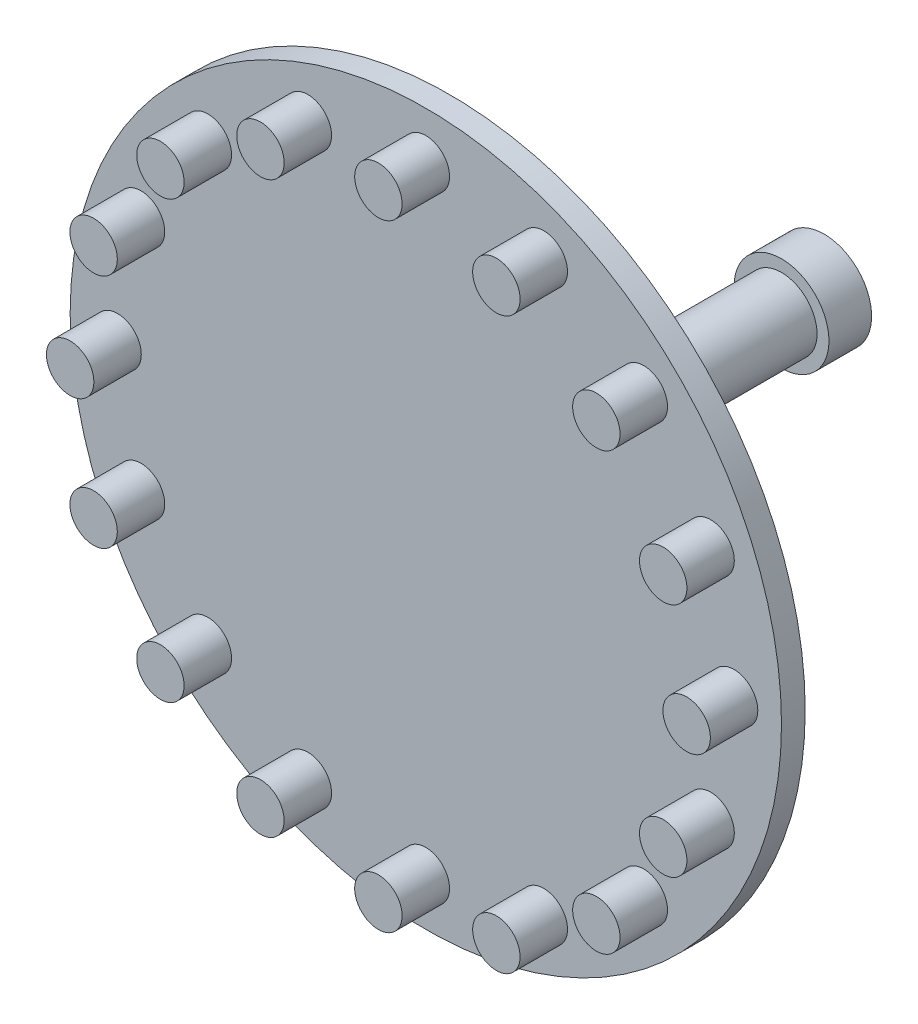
from build123d import *

# Parameters (mm, degrees)
SKETCH2_R           = 7.5
BOSS_EXTRUDE1_DEPTH = 70
SKETCH3_R           = 75
BOSS_EXTRUDE2_DEPTH = 5
SKETCH4_R           = 10
BOSS_EXTRUDE3_DEPTH = 9
SKETCH5_R           = 2.5
CUT_EXTRUDE1_DEPTH  = 5
SKETCH6_R           = 5
BOSS_EXTRUDE4_DEPTH = 10


with BuildPart() as part:
    # Sketch2 → Boss-Extrude1 (new body)
    with BuildSketch(Plane.XY):
        Circle(SKETCH2_R)
    extrude(amount=BOSS_EXTRUDE1_DEPTH)

    # Sketch3 → Boss-Extrude2 (add)
    with BuildSketch(Plane.XY.offset(70)):
        Circle(SKETCH3_R)
    extrude(amount=BOSS_EXTRUDE2_DEPTH)

    # Sketch4 → Boss-Extrude3 (add)
    with BuildSketch(Plane(origin=(0, 0, 0), x_dir=(-1, 0, 0), z_dir=(0, 0, -1))):
        Circle(SKETCH4_R)
    extrude(amount=BOSS_EXTRUDE3_DEPTH)

    # Sketch5 → Cut-Extrude1 (cut)
    with BuildSketch(Plane(origin=(0, 0, -9), x_dir=(-1, 0, 0), z_dir=(0, 0, -1))):
        Circle(SKETCH5_R)
    extrude(amount=-CUT_EXTRUDE1_DEPTH, mode=Mode.SUBTRACT)

    # Sketch6 → Boss-Extrude4 (add)
    with BuildSketch(Plane.XY.offset(75)):
        with Locations((-24.874423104, -60.052169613)):
            Circle(SKETCH6_R)
        with Locations((-45.961940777, -45.961940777)):
            Circle(SKETCH6_R)
        with Locations((-60.052169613, -24.874423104)):
            Circle(SKETCH6_R)
        with Locations((-65, 0)):
            Circle(SKETCH6_R)
        with Locations((-45.961940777, 45.961940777)):
            Circle(SKETCH6_R)
        with Locations((-60.052169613, 24.874423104)):
            Circle(SKETCH6_R)
        with Locations((-24.874423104, 60.052169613)):
            Circle(SKETCH6_R)
        with Locations((0, 65)):
            Circle(SKETCH6_R)
        with Locations((24.874423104, 60.052169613)):
            Circle(SKETCH6_R)
        with Locations((45.961940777, 45.961940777)):
            Circle(SKETCH6_R)
        with Locations((60.052169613, 24.874423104)):
            Circle(SKETCH6_R)
        with Locations((65, 0)):
            Circle(SKETCH6_R)
        with Locations((60.052169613, -24.874423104)):
            Circle(SKETCH6_R)
        with Locations((45.961940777, -45.961940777)):
            Circle(SKETCH6_R)
        with Locations((24.874423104, -60.052169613)):
            Circle(SKETCH6_R)
        with Locations((0, -65)):
            Circle(SKETCH6_R)
    extrude(amount=BOSS_EXTRUDE4_DEPTH)


solid = part.part
